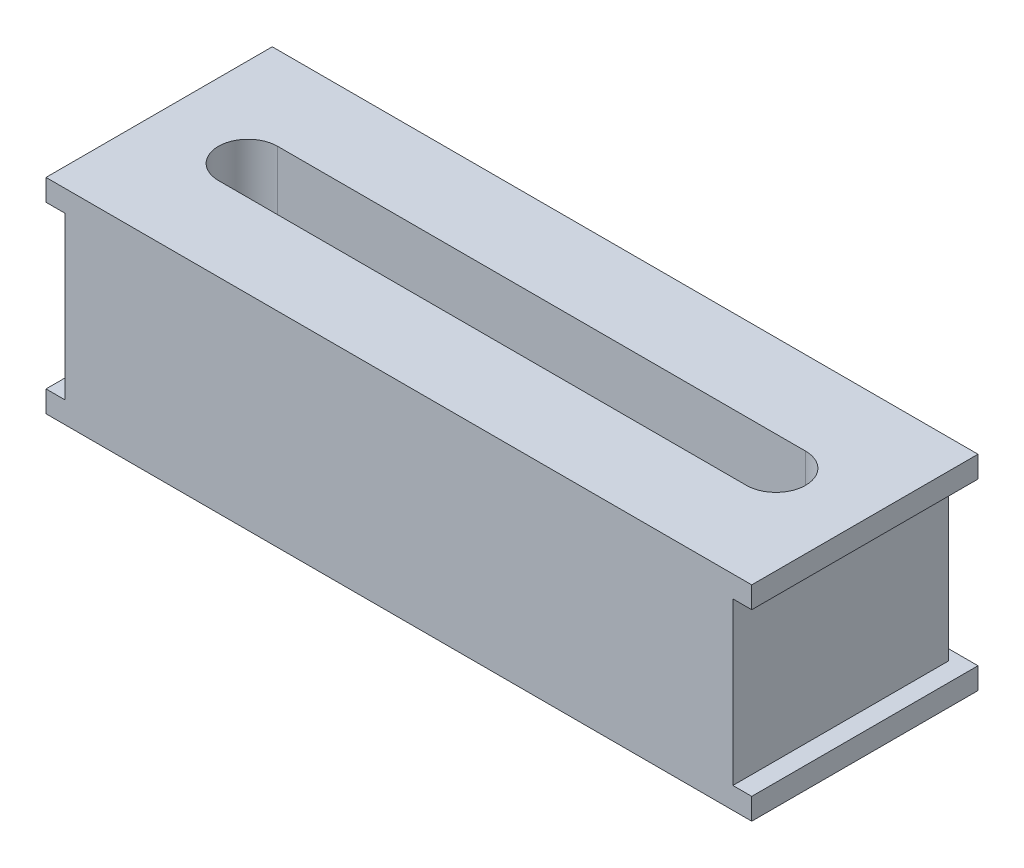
ISO-10303-21;
HEADER;
FILE_DESCRIPTION(('STEP AP214'),'2;1');
FILE_NAME('part.step','',(''),(''),'','','');
FILE_SCHEMA(('AUTOMOTIVE_DESIGN { 1 0 10303 214 1 1 1 1 }'));
ENDSEC;
DATA;
#1=APPLICATION_CONTEXT('core data for automotive mechanical design processes');
#2=APPLICATION_PROTOCOL_DEFINITION('international standard','automotive_design',2000,#1);
#3=PRODUCT_CONTEXT('',#1,'mechanical');
#4=PRODUCT('Part','Part','',(#3));
#5=PRODUCT_RELATED_PRODUCT_CATEGORY('part','',(#4));
#6=PRODUCT_DEFINITION_FORMATION('','',#4);
#7=PRODUCT_DEFINITION_CONTEXT('part definition',#1,'design');
#8=PRODUCT_DEFINITION('design','',#6,#7);
#9=PRODUCT_DEFINITION_SHAPE('','',#8);
#10=(LENGTH_UNIT() NAMED_UNIT(*) SI_UNIT(.MILLI.,.METRE.));
#11=(NAMED_UNIT(*) PLANE_ANGLE_UNIT() SI_UNIT($,.RADIAN.));
#12=(NAMED_UNIT(*) SI_UNIT($,.STERADIAN.) SOLID_ANGLE_UNIT());
#13=UNCERTAINTY_MEASURE_WITH_UNIT(LENGTH_MEASURE(1.E-05),#10,'distance_accuracy_value','');
#14=(GEOMETRIC_REPRESENTATION_CONTEXT(3) GLOBAL_UNCERTAINTY_ASSIGNED_CONTEXT((#13)) GLOBAL_UNIT_ASSIGNED_CONTEXT((#10,
#11,#12)) REPRESENTATION_CONTEXT('',''));
#15=CARTESIAN_POINT('',(0.,0.,0.));
#16=DIRECTION('',(0.,0.,1.));
#17=DIRECTION('',(1.,0.,0.));
#18=AXIS2_PLACEMENT_3D('',#15,#16,#17);
#19=CARTESIAN_POINT('',(-32.75,-8.95,10.5));
#20=DIRECTION('',(0.,1.,0.));
#21=DIRECTION('',(1.,0.,0.));
#22=AXIS2_PLACEMENT_3D('',#19,#20,#21);
#23=PLANE('',#22);
#24=DIRECTION('',(-1.,0.,0.));
#25=VECTOR('',#24,1.);
#26=CARTESIAN_POINT('',(26.0811388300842,-8.95,-2.25));
#27=LINE('',#26,#25);
#28=CARTESIAN_POINT('',(26.0811388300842,-8.95,-2.25));
#29=VERTEX_POINT('',#28);
#30=CARTESIAN_POINT('',(-18.75,-8.95,-2.25));
#31=VERTEX_POINT('',#30);
#32=EDGE_CURVE('E220',#29,#31,#27,.T.);
#33=ORIENTED_EDGE('',*,*,#32,.F.);
#34=CARTESIAN_POINT('',(24.5,-8.95,0.));
#35=DIRECTION('',(0.,-1.,0.));
#36=DIRECTION('',(0.,0.,1.));
#37=AXIS2_PLACEMENT_3D('',#34,#35,#36);
#38=CIRCLE('',#37,2.75);
#39=CARTESIAN_POINT('',(24.5,-8.95,-2.75));
#40=VERTEX_POINT('',#39);
#41=EDGE_CURVE('E18',#40,#29,#38,.T.);
#42=ORIENTED_EDGE('',*,*,#41,.F.);
#43=DIRECTION('',(1.,0.,0.));
#44=VECTOR('',#43,1.);
#45=CARTESIAN_POINT('',(0.,-8.95,-2.75));
#46=LINE('',#45,#44);
#47=CARTESIAN_POINT('',(-24.5,-8.95,-2.75));
#48=VERTEX_POINT('',#47);
#49=EDGE_CURVE('E9',#48,#40,#46,.T.);
#50=ORIENTED_EDGE('',*,*,#49,.F.);
#51=CARTESIAN_POINT('',(-24.5,-8.95,0.));
#52=DIRECTION('',(0.,-1.,0.));
#53=DIRECTION('',(0.,0.,1.));
#54=AXIS2_PLACEMENT_3D('',#51,#52,#53);
#55=CIRCLE('',#54,2.75);
#56=CARTESIAN_POINT('',(-24.5,-8.95,2.75));
#57=VERTEX_POINT('',#56);
#58=EDGE_CURVE('E204',#57,#48,#55,.T.);
#59=ORIENTED_EDGE('',*,*,#58,.F.);
#60=DIRECTION('',(-1.,0.,0.));
#61=VECTOR('',#60,1.);
#62=CARTESIAN_POINT('',(0.,-8.95,2.75));
#63=LINE('',#62,#61);
#64=CARTESIAN_POINT('',(-18.75,-8.95,2.75));
#65=VERTEX_POINT('',#64);
#66=EDGE_CURVE('E187',#65,#57,#63,.T.);
#67=ORIENTED_EDGE('',*,*,#66,.F.);
#68=CARTESIAN_POINT('',(-18.75,-8.95,0.25));
#69=DIRECTION('',(0.,1.,0.));
#70=DIRECTION('',(0.,0.,1.));
#71=AXIS2_PLACEMENT_3D('',#68,#69,#70);
#72=CIRCLE('',#71,2.5);
#73=EDGE_CURVE('E374',#31,#65,#72,.T.);
#74=ORIENTED_EDGE('',*,*,#73,.F.);
#75=EDGE_LOOP('',(#33,#42,#50,#59,#67,#74));
#76=FACE_BOUND('',#75,.T.);
#77=ADVANCED_FACE('F15',(#76),#23,.T.);
#78=CARTESIAN_POINT('',(24.5,10.5,-2.75));
#79=DIRECTION('',(0.,0.,-1.));
#80=DIRECTION('',(-1.,0.,0.));
#81=AXIS2_PLACEMENT_3D('',#78,#79,#80);
#82=PLANE('',#81);
#83=ORIENTED_EDGE('',*,*,#49,.T.);
#84=DIRECTION('',(0.,-1.,0.));
#85=VECTOR('',#84,1.);
#86=CARTESIAN_POINT('',(24.5,10.5,-2.75));
#87=LINE('',#86,#85);
#88=CARTESIAN_POINT('',(24.5,9.5,-2.75));
#89=VERTEX_POINT('',#88);
#90=EDGE_CURVE('E40',#89,#40,#87,.T.);
#91=ORIENTED_EDGE('',*,*,#90,.F.);
#92=DIRECTION('',(1.,0.,0.));
#93=VECTOR('',#92,1.);
#94=CARTESIAN_POINT('',(-32.75,9.5,-2.75));
#95=LINE('',#94,#93);
#96=CARTESIAN_POINT('',(-24.5,9.5,-2.75));
#97=VERTEX_POINT('',#96);
#98=EDGE_CURVE('E352',#97,#89,#95,.T.);
#99=ORIENTED_EDGE('',*,*,#98,.F.);
#100=DIRECTION('',(0.,-1.,0.));
#101=VECTOR('',#100,1.);
#102=CARTESIAN_POINT('',(-24.5,10.5,-2.75));
#103=LINE('',#102,#101);
#104=EDGE_CURVE('E209',#97,#48,#103,.T.);
#105=ORIENTED_EDGE('',*,*,#104,.T.);
#106=EDGE_LOOP('',(#83,#91,#99,#105));
#107=FACE_BOUND('',#106,.T.);
#108=ADVANCED_FACE('F470',(#107),#82,.F.);
#109=CARTESIAN_POINT('',(24.5,10.5,0.));
#110=DIRECTION('',(0.,-1.,0.));
#111=DIRECTION('',(0.,0.,-1.));
#112=AXIS2_PLACEMENT_3D('',#109,#110,#111);
#113=CYLINDRICAL_SURFACE('',#112,2.75);
#114=ORIENTED_EDGE('',*,*,#90,.T.);
#115=ORIENTED_EDGE('',*,*,#41,.T.);
#116=DIRECTION('',(0.,-1.,0.));
#117=VECTOR('',#116,1.);
#118=CARTESIAN_POINT('',(26.0811388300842,-8.,-2.25));
#119=LINE('',#118,#117);
#120=CARTESIAN_POINT('',(26.0811388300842,-9.5,-2.25));
#121=VERTEX_POINT('',#120);
#122=EDGE_CURVE('E373',#29,#121,#119,.T.);
#123=ORIENTED_EDGE('',*,*,#122,.T.);
#124=CARTESIAN_POINT('',(24.5,-9.5,0.));
#125=DIRECTION('',(0.,-1.,0.));
#126=DIRECTION('',(0.,0.,-1.));
#127=AXIS2_PLACEMENT_3D('',#124,#125,#126);
#128=CIRCLE('',#127,2.75);
#129=CARTESIAN_POINT('',(24.5,-9.5,2.75));
#130=VERTEX_POINT('',#129);
#131=EDGE_CURVE('E346',#121,#130,#128,.T.);
#132=ORIENTED_EDGE('',*,*,#131,.T.);
#133=DIRECTION('',(0.,-1.,0.));
#134=VECTOR('',#133,1.);
#135=CARTESIAN_POINT('',(24.5,10.5,2.75));
#136=LINE('',#135,#134);
#137=CARTESIAN_POINT('',(24.5,9.5,2.75));
#138=VERTEX_POINT('',#137);
#139=EDGE_CURVE('E231',#138,#130,#136,.T.);
#140=ORIENTED_EDGE('',*,*,#139,.F.);
#141=CARTESIAN_POINT('',(24.5,9.5,0.));
#142=DIRECTION('',(0.,-1.,0.));
#143=DIRECTION('',(0.,0.,-1.));
#144=AXIS2_PLACEMENT_3D('',#141,#142,#143);
#145=CIRCLE('',#144,2.75);
#146=EDGE_CURVE('E356',#89,#138,#145,.T.);
#147=ORIENTED_EDGE('',*,*,#146,.F.);
#148=EDGE_LOOP('',(#114,#115,#123,#132,#140,#147));
#149=FACE_BOUND('',#148,.T.);
#150=ADVANCED_FACE('F371',(#149),#113,.F.);
#151=CARTESIAN_POINT('',(32.75,-7.5,-9.5));
#152=DIRECTION('',(0.,0.,-1.));
#153=DIRECTION('',(0.,-1.,0.));
#154=AXIS2_PLACEMENT_3D('',#151,#152,#153);
#155=PLANE('',#154);
#156=DIRECTION('',(0.,-1.,0.));
#157=VECTOR('',#156,1.);
#158=CARTESIAN_POINT('',(31.,1.75,-9.5));
#159=LINE('',#158,#157);
#160=CARTESIAN_POINT('',(31.,7.5,-9.5));
#161=VERTEX_POINT('',#160);
#162=CARTESIAN_POINT('',(31.,-7.5,-9.5));
#163=VERTEX_POINT('',#162);
#164=EDGE_CURVE('E256',#161,#163,#159,.T.);
#165=ORIENTED_EDGE('',*,*,#164,.T.);
#166=DIRECTION('',(-1.,0.,0.));
#167=VECTOR('',#166,1.);
#168=CARTESIAN_POINT('',(32.75,-7.5,-9.5));
#169=LINE('',#168,#167);
#170=CARTESIAN_POINT('',(-31.,-7.5,-9.5));
#171=VERTEX_POINT('',#170);
#172=EDGE_CURVE('E362',#163,#171,#169,.T.);
#173=ORIENTED_EDGE('',*,*,#172,.T.);
#174=DIRECTION('',(0.,-1.,0.));
#175=VECTOR('',#174,1.);
#176=CARTESIAN_POINT('',(-31.,1.75,-9.5));
#177=LINE('',#176,#175);
#178=CARTESIAN_POINT('',(-31.,7.5,-9.5));
#179=VERTEX_POINT('',#178);
#180=EDGE_CURVE('E285',#179,#171,#177,.T.);
#181=ORIENTED_EDGE('',*,*,#180,.F.);
#182=DIRECTION('',(1.,0.,0.));
#183=VECTOR('',#182,1.);
#184=CARTESIAN_POINT('',(32.75,7.5,-9.5));
#185=LINE('',#184,#183);
#186=EDGE_CURVE('E359',#179,#161,#185,.T.);
#187=ORIENTED_EDGE('',*,*,#186,.T.);
#188=EDGE_LOOP('',(#165,#173,#181,#187));
#189=FACE_BOUND('',#188,.T.);
#190=ADVANCED_FACE('F407',(#189),#155,.T.);
#191=CARTESIAN_POINT('',(32.75,-7.5,-11.5));
#192=DIRECTION('',(0.,-1.,0.));
#193=DIRECTION('',(0.,0.,-1.));
#194=AXIS2_PLACEMENT_3D('',#191,#192,#193);
#195=PLANE('',#194);
#196=DIRECTION('',(0.,0.,1.));
#197=VECTOR('',#196,1.);
#198=CARTESIAN_POINT('',(31.,-7.5,-24.6017383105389));
#199=LINE('',#198,#197);
#200=CARTESIAN_POINT('',(31.,-7.5,10.5));
#201=VERTEX_POINT('',#200);
#202=EDGE_CURVE('E268',#163,#201,#199,.T.);
#203=ORIENTED_EDGE('',*,*,#202,.T.);
#204=DIRECTION('',(1.,0.,0.));
#205=VECTOR('',#204,1.);
#206=CARTESIAN_POINT('',(32.75,-7.5,10.5));
#207=LINE('',#206,#205);
#208=CARTESIAN_POINT('',(32.75,-7.5,10.5));
#209=VERTEX_POINT('',#208);
#210=EDGE_CURVE('E310',#201,#209,#207,.T.);
#211=ORIENTED_EDGE('',*,*,#210,.T.);
#212=DIRECTION('',(0.,0.,1.));
#213=VECTOR('',#212,1.);
#214=CARTESIAN_POINT('',(32.75,-7.5,-11.5));
#215=LINE('',#214,#213);
#216=CARTESIAN_POINT('',(32.75,-7.5,-10.5));
#217=VERTEX_POINT('',#216);
#218=EDGE_CURVE('E349',#217,#209,#215,.T.);
#219=ORIENTED_EDGE('',*,*,#218,.F.);
#220=DIRECTION('',(1.,0.,0.));
#221=VECTOR('',#220,1.);
#222=CARTESIAN_POINT('',(-32.75,-7.5,-10.5));
#223=LINE('',#222,#221);
#224=CARTESIAN_POINT('',(-32.75,-7.5,-10.5));
#225=VERTEX_POINT('',#224);
#226=EDGE_CURVE('E327',#225,#217,#223,.T.);
#227=ORIENTED_EDGE('',*,*,#226,.F.);
#228=DIRECTION('',(0.,0.,1.));
#229=VECTOR('',#228,1.);
#230=CARTESIAN_POINT('',(-32.75,-7.5,-11.5));
#231=LINE('',#230,#229);
#232=CARTESIAN_POINT('',(-32.75,-7.5,10.5));
#233=VERTEX_POINT('',#232);
#234=EDGE_CURVE('E293',#225,#233,#231,.T.);
#235=ORIENTED_EDGE('',*,*,#234,.T.);
#236=DIRECTION('',(-1.,0.,0.));
#237=VECTOR('',#236,1.);
#238=CARTESIAN_POINT('',(-32.75,-7.5,10.5));
#239=LINE('',#238,#237);
#240=CARTESIAN_POINT('',(-31.,-7.5,10.5));
#241=VERTEX_POINT('',#240);
#242=EDGE_CURVE('E241',#241,#233,#239,.T.);
#243=ORIENTED_EDGE('',*,*,#242,.F.);
#244=DIRECTION('',(0.,0.,1.));
#245=VECTOR('',#244,1.);
#246=CARTESIAN_POINT('',(-31.,-7.5,-24.6017383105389));
#247=LINE('',#246,#245);
#248=EDGE_CURVE('E289',#171,#241,#247,.T.);
#249=ORIENTED_EDGE('',*,*,#248,.F.);
#250=ORIENTED_EDGE('',*,*,#172,.F.);
#251=EDGE_LOOP('',(#203,#211,#219,#227,#235,#243,#249,#250));
#252=FACE_BOUND('',#251,.T.);
#253=ADVANCED_FACE('F457',(#252),#195,.F.);
#254=CARTESIAN_POINT('',(32.75,7.5,-11.5));
#255=DIRECTION('',(0.,1.,0.));
#256=DIRECTION('',(1.,0.,0.));
#257=AXIS2_PLACEMENT_3D('',#254,#255,#256);
#258=PLANE('',#257);
#259=DIRECTION('',(-1.,0.,0.));
#260=VECTOR('',#259,1.);
#261=CARTESIAN_POINT('',(32.75,7.5,10.5));
#262=LINE('',#261,#260);
#263=CARTESIAN_POINT('',(32.75,7.5,10.5));
#264=VERTEX_POINT('',#263);
#265=CARTESIAN_POINT('',(31.,7.5,10.5));
#266=VERTEX_POINT('',#265);
#267=EDGE_CURVE('E315',#264,#266,#262,.T.);
#268=ORIENTED_EDGE('',*,*,#267,.T.);
#269=DIRECTION('',(0.,0.,1.));
#270=VECTOR('',#269,1.);
#271=CARTESIAN_POINT('',(31.,7.5,-24.6017383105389));
#272=LINE('',#271,#270);
#273=EDGE_CURVE('E260',#161,#266,#272,.T.);
#274=ORIENTED_EDGE('',*,*,#273,.F.);
#275=ORIENTED_EDGE('',*,*,#186,.F.);
#276=DIRECTION('',(0.,0.,1.));
#277=VECTOR('',#276,1.);
#278=CARTESIAN_POINT('',(-31.,7.5,-24.6017383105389));
#279=LINE('',#278,#277);
#280=CARTESIAN_POINT('',(-31.,7.5,10.5));
#281=VERTEX_POINT('',#280);
#282=EDGE_CURVE('E281',#179,#281,#279,.T.);
#283=ORIENTED_EDGE('',*,*,#282,.T.);
#284=DIRECTION('',(1.,0.,0.));
#285=VECTOR('',#284,1.);
#286=CARTESIAN_POINT('',(-32.75,7.5,10.5));
#287=LINE('',#286,#285);
#288=CARTESIAN_POINT('',(-32.75,7.5,10.5));
#289=VERTEX_POINT('',#288);
#290=EDGE_CURVE('E238',#289,#281,#287,.T.);
#291=ORIENTED_EDGE('',*,*,#290,.F.);
#292=DIRECTION('',(0.,0.,1.));
#293=VECTOR('',#292,1.);
#294=CARTESIAN_POINT('',(-32.75,7.5,-11.5));
#295=LINE('',#294,#293);
#296=CARTESIAN_POINT('',(-32.75,7.5,-10.5));
#297=VERTEX_POINT('',#296);
#298=EDGE_CURVE('E306',#297,#289,#295,.T.);
#299=ORIENTED_EDGE('',*,*,#298,.F.);
#300=DIRECTION('',(-1.,0.,0.));
#301=VECTOR('',#300,1.);
#302=CARTESIAN_POINT('',(-32.75,7.5,-10.5));
#303=LINE('',#302,#301);
#304=CARTESIAN_POINT('',(32.75,7.5,-10.5));
#305=VERTEX_POINT('',#304);
#306=EDGE_CURVE('E228',#305,#297,#303,.T.);
#307=ORIENTED_EDGE('',*,*,#306,.F.);
#308=DIRECTION('',(0.,0.,1.));
#309=VECTOR('',#308,1.);
#310=CARTESIAN_POINT('',(32.75,7.5,-11.5));
#311=LINE('',#310,#309);
#312=EDGE_CURVE('E339',#305,#264,#311,.T.);
#313=ORIENTED_EDGE('',*,*,#312,.T.);
#314=EDGE_LOOP('',(#268,#274,#275,#283,#291,#299,#307,#313));
#315=FACE_BOUND('',#314,.T.);
#316=ADVANCED_FACE('F397',(#315),#258,.F.);
#317=CARTESIAN_POINT('',(-32.75,9.5,10.5));
#318=DIRECTION('',(0.,-1.,0.));
#319=DIRECTION('',(0.,0.,-1.));
#320=AXIS2_PLACEMENT_3D('',#317,#318,#319);
#321=PLANE('',#320);
#322=DIRECTION('',(-1.,0.,0.));
#323=VECTOR('',#322,1.);
#324=CARTESIAN_POINT('',(-32.75,9.5,2.75));
#325=LINE('',#324,#323);
#326=CARTESIAN_POINT('',(-24.5,9.5,2.75));
#327=VERTEX_POINT('',#326);
#328=EDGE_CURVE('E200',#138,#327,#325,.T.);
#329=ORIENTED_EDGE('',*,*,#328,.T.);
#330=CARTESIAN_POINT('',(-24.5,9.5,0.));
#331=DIRECTION('',(0.,-1.,0.));
#332=DIRECTION('',(0.,0.,-1.));
#333=AXIS2_PLACEMENT_3D('',#330,#331,#332);
#334=CIRCLE('',#333,2.75);
#335=EDGE_CURVE('E214',#327,#97,#334,.T.);
#336=ORIENTED_EDGE('',*,*,#335,.T.);
#337=ORIENTED_EDGE('',*,*,#98,.T.);
#338=ORIENTED_EDGE('',*,*,#146,.T.);
#339=EDGE_LOOP('',(#329,#336,#337,#338));
#340=FACE_BOUND('',#339,.T.);
#341=DIRECTION('',(0.,0.,-1.));
#342=VECTOR('',#341,1.);
#343=CARTESIAN_POINT('',(32.75,9.5,10.5));
#344=LINE('',#343,#342);
#345=CARTESIAN_POINT('',(32.75,9.5,10.5));
#346=VERTEX_POINT('',#345);
#347=CARTESIAN_POINT('',(32.75,9.5,-10.5));
#348=VERTEX_POINT('',#347);
#349=EDGE_CURVE('E340',#346,#348,#344,.T.);
#350=ORIENTED_EDGE('',*,*,#349,.T.);
#351=DIRECTION('',(-1.,0.,0.));
#352=VECTOR('',#351,1.);
#353=CARTESIAN_POINT('',(-32.75,9.5,-10.5));
#354=LINE('',#353,#352);
#355=CARTESIAN_POINT('',(-32.75,9.5,-10.5));
#356=VERTEX_POINT('',#355);
#357=EDGE_CURVE('E248',#348,#356,#354,.T.);
#358=ORIENTED_EDGE('',*,*,#357,.T.);
#359=DIRECTION('',(0.,0.,-1.));
#360=VECTOR('',#359,1.);
#361=CARTESIAN_POINT('',(-32.75,9.5,10.5));
#362=LINE('',#361,#360);
#363=CARTESIAN_POINT('',(-32.75,9.5,10.5));
#364=VERTEX_POINT('',#363);
#365=EDGE_CURVE('E307',#364,#356,#362,.T.);
#366=ORIENTED_EDGE('',*,*,#365,.F.);
#367=DIRECTION('',(-1.,0.,0.));
#368=VECTOR('',#367,1.);
#369=CARTESIAN_POINT('',(-32.75,9.5,10.5));
#370=LINE('',#369,#368);
#371=EDGE_CURVE('E242',#346,#364,#370,.T.);
#372=ORIENTED_EDGE('',*,*,#371,.F.);
#373=EDGE_LOOP('',(#350,#358,#366,#372));
#374=FACE_BOUND('',#373,.T.);
#375=ADVANCED_FACE('F465',(#340,#374),#321,.F.);
#376=CARTESIAN_POINT('',(32.75,9.5,10.5));
#377=DIRECTION('',(-1.,0.,0.));
#378=DIRECTION('',(0.,1.,0.));
#379=AXIS2_PLACEMENT_3D('',#376,#377,#378);
#380=PLANE('',#379);
#381=DIRECTION('',(0.,1.,0.));
#382=VECTOR('',#381,1.);
#383=CARTESIAN_POINT('',(32.75,9.5,-10.5));
#384=LINE('',#383,#382);
#385=CARTESIAN_POINT('',(32.75,-9.5,-10.5));
#386=VERTEX_POINT('',#385);
#387=EDGE_CURVE('E331',#386,#217,#384,.T.);
#388=ORIENTED_EDGE('',*,*,#387,.T.);
#389=ORIENTED_EDGE('',*,*,#218,.T.);
#390=DIRECTION('',(0.,1.,0.));
#391=VECTOR('',#390,1.);
#392=CARTESIAN_POINT('',(32.75,9.5,10.5));
#393=LINE('',#392,#391);
#394=CARTESIAN_POINT('',(32.75,-9.5,10.5));
#395=VERTEX_POINT('',#394);
#396=EDGE_CURVE('E273',#395,#209,#393,.T.);
#397=ORIENTED_EDGE('',*,*,#396,.F.);
#398=DIRECTION('',(0.,0.,-1.));
#399=VECTOR('',#398,1.);
#400=CARTESIAN_POINT('',(32.75,-9.5,10.5));
#401=LINE('',#400,#399);
#402=EDGE_CURVE('E343',#395,#386,#401,.T.);
#403=ORIENTED_EDGE('',*,*,#402,.T.);
#404=EDGE_LOOP('',(#388,#389,#397,#403));
#405=FACE_BOUND('',#404,.T.);
#406=ADVANCED_FACE('F454',(#405),#380,.F.);
#407=CARTESIAN_POINT('',(-32.75,-9.5,10.5));
#408=DIRECTION('',(0.,1.,0.));
#409=DIRECTION('',(1.,0.,0.));
#410=AXIS2_PLACEMENT_3D('',#407,#408,#409);
#411=PLANE('',#410);
#412=ORIENTED_EDGE('',*,*,#131,.F.);
#413=DIRECTION('',(-1.,0.,0.));
#414=VECTOR('',#413,1.);
#415=CARTESIAN_POINT('',(26.0811388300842,-9.5,-2.25));
#416=LINE('',#415,#414);
#417=CARTESIAN_POINT('',(-18.75,-9.5,-2.25));
#418=VERTEX_POINT('',#417);
#419=EDGE_CURVE('E216',#121,#418,#416,.T.);
#420=ORIENTED_EDGE('',*,*,#419,.T.);
#421=CARTESIAN_POINT('',(-18.75,-9.5,0.25));
#422=DIRECTION('',(0.,1.,0.));
#423=DIRECTION('',(0.,0.,1.));
#424=AXIS2_PLACEMENT_3D('',#421,#422,#423);
#425=CIRCLE('',#424,2.5);
#426=CARTESIAN_POINT('',(-18.75,-9.5,2.75));
#427=VERTEX_POINT('',#426);
#428=EDGE_CURVE('E383',#418,#427,#425,.T.);
#429=ORIENTED_EDGE('',*,*,#428,.T.);
#430=DIRECTION('',(-1.,0.,0.));
#431=VECTOR('',#430,1.);
#432=CARTESIAN_POINT('',(-24.5,-9.5,2.75));
#433=LINE('',#432,#431);
#434=EDGE_CURVE('E201',#130,#427,#433,.T.);
#435=ORIENTED_EDGE('',*,*,#434,.F.);
#436=EDGE_LOOP('',(#412,#420,#429,#435));
#437=FACE_BOUND('',#436,.T.);
#438=DIRECTION('',(0.,0.,-1.));
#439=VECTOR('',#438,1.);
#440=CARTESIAN_POINT('',(-32.75,-9.5,10.5));
#441=LINE('',#440,#439);
#442=CARTESIAN_POINT('',(-32.75,-9.5,10.5));
#443=VERTEX_POINT('',#442);
#444=CARTESIAN_POINT('',(-32.75,-9.5,-10.5));
#445=VERTEX_POINT('',#444);
#446=EDGE_CURVE('E301',#443,#445,#441,.T.);
#447=ORIENTED_EDGE('',*,*,#446,.T.);
#448=DIRECTION('',(1.,0.,0.));
#449=VECTOR('',#448,1.);
#450=CARTESIAN_POINT('',(-32.75,-9.5,-10.5));
#451=LINE('',#450,#449);
#452=EDGE_CURVE('E335',#445,#386,#451,.T.);
#453=ORIENTED_EDGE('',*,*,#452,.T.);
#454=ORIENTED_EDGE('',*,*,#402,.F.);
#455=DIRECTION('',(1.,0.,0.));
#456=VECTOR('',#455,1.);
#457=CARTESIAN_POINT('',(-32.75,-9.5,10.5));
#458=LINE('',#457,#456);
#459=EDGE_CURVE('E269',#443,#395,#458,.T.);
#460=ORIENTED_EDGE('',*,*,#459,.F.);
#461=EDGE_LOOP('',(#447,#453,#454,#460));
#462=FACE_BOUND('',#461,.T.);
#463=ADVANCED_FACE('F445',(#437,#462),#411,.F.);
#464=CARTESIAN_POINT('',(32.75,9.5,10.5));
#465=DIRECTION('',(-1.,0.,0.));
#466=DIRECTION('',(0.,1.,0.));
#467=AXIS2_PLACEMENT_3D('',#464,#465,#466);
#468=PLANE('',#467);
#469=DIRECTION('',(0.,1.,0.));
#470=VECTOR('',#469,1.);
#471=CARTESIAN_POINT('',(32.75,9.5,10.5));
#472=LINE('',#471,#470);
#473=EDGE_CURVE('E316',#264,#346,#472,.T.);
#474=ORIENTED_EDGE('',*,*,#473,.F.);
#475=ORIENTED_EDGE('',*,*,#312,.F.);
#476=DIRECTION('',(0.,1.,0.));
#477=VECTOR('',#476,1.);
#478=CARTESIAN_POINT('',(32.75,9.5,-10.5));
#479=LINE('',#478,#477);
#480=EDGE_CURVE('E252',#305,#348,#479,.T.);
#481=ORIENTED_EDGE('',*,*,#480,.T.);
#482=ORIENTED_EDGE('',*,*,#349,.F.);
#483=EDGE_LOOP('',(#474,#475,#481,#482));
#484=FACE_BOUND('',#483,.T.);
#485=ADVANCED_FACE('F529',(#484),#468,.F.);
#486=CARTESIAN_POINT('',(-32.75,-9.5,-10.5));
#487=DIRECTION('',(0.,0.,1.));
#488=DIRECTION('',(1.,0.,0.));
#489=AXIS2_PLACEMENT_3D('',#486,#487,#488);
#490=PLANE('',#489);
#491=DIRECTION('',(0.,-1.,0.));
#492=VECTOR('',#491,1.);
#493=CARTESIAN_POINT('',(-32.75,9.5,-10.5));
#494=LINE('',#493,#492);
#495=EDGE_CURVE('E297',#225,#445,#494,.T.);
#496=ORIENTED_EDGE('',*,*,#495,.F.);
#497=ORIENTED_EDGE('',*,*,#226,.T.);
#498=ORIENTED_EDGE('',*,*,#387,.F.);
#499=ORIENTED_EDGE('',*,*,#452,.F.);
#500=EDGE_LOOP('',(#496,#497,#498,#499));
#501=FACE_BOUND('',#500,.T.);
#502=ADVANCED_FACE('F452',(#501),#490,.F.);
#503=CARTESIAN_POINT('',(-32.75,-9.5,10.5));
#504=DIRECTION('',(0.,0.,1.));
#505=DIRECTION('',(1.,0.,0.));
#506=AXIS2_PLACEMENT_3D('',#503,#504,#505);
#507=PLANE('',#506);
#508=ORIENTED_EDGE('',*,*,#210,.F.);
#509=DIRECTION('',(0.,-1.,0.));
#510=VECTOR('',#509,1.);
#511=CARTESIAN_POINT('',(31.,1.75,10.5));
#512=LINE('',#511,#510);
#513=EDGE_CURVE('E264',#266,#201,#512,.T.);
#514=ORIENTED_EDGE('',*,*,#513,.F.);
#515=ORIENTED_EDGE('',*,*,#267,.F.);
#516=ORIENTED_EDGE('',*,*,#473,.T.);
#517=ORIENTED_EDGE('',*,*,#371,.T.);
#518=DIRECTION('',(0.,-1.,0.));
#519=VECTOR('',#518,1.);
#520=CARTESIAN_POINT('',(-32.75,9.5,10.5));
#521=LINE('',#520,#519);
#522=EDGE_CURVE('E311',#364,#289,#521,.T.);
#523=ORIENTED_EDGE('',*,*,#522,.T.);
#524=ORIENTED_EDGE('',*,*,#290,.T.);
#525=DIRECTION('',(0.,-1.,0.));
#526=VECTOR('',#525,1.);
#527=CARTESIAN_POINT('',(-31.,1.75,10.5));
#528=LINE('',#527,#526);
#529=EDGE_CURVE('E276',#281,#241,#528,.T.);
#530=ORIENTED_EDGE('',*,*,#529,.T.);
#531=ORIENTED_EDGE('',*,*,#242,.T.);
#532=DIRECTION('',(0.,-1.,0.));
#533=VECTOR('',#532,1.);
#534=CARTESIAN_POINT('',(-32.75,9.5,10.5));
#535=LINE('',#534,#533);
#536=EDGE_CURVE('E302',#233,#443,#535,.T.);
#537=ORIENTED_EDGE('',*,*,#536,.T.);
#538=ORIENTED_EDGE('',*,*,#459,.T.);
#539=ORIENTED_EDGE('',*,*,#396,.T.);
#540=EDGE_LOOP('',(#508,#514,#515,#516,#517,#523,#524,#530,#531,#537,#538,#539));
#541=FACE_BOUND('',#540,.T.);
#542=ADVANCED_FACE('F402',(#541),#507,.T.);
#543=CARTESIAN_POINT('',(-32.75,9.5,10.5));
#544=DIRECTION('',(1.,0.,0.));
#545=DIRECTION('',(0.,1.,0.));
#546=AXIS2_PLACEMENT_3D('',#543,#544,#545);
#547=PLANE('',#546);
#548=ORIENTED_EDGE('',*,*,#298,.T.);
#549=ORIENTED_EDGE('',*,*,#522,.F.);
#550=ORIENTED_EDGE('',*,*,#365,.T.);
#551=DIRECTION('',(0.,-1.,0.));
#552=VECTOR('',#551,1.);
#553=CARTESIAN_POINT('',(-32.75,9.5,-10.5));
#554=LINE('',#553,#552);
#555=EDGE_CURVE('E235',#356,#297,#554,.T.);
#556=ORIENTED_EDGE('',*,*,#555,.T.);
#557=EDGE_LOOP('',(#548,#549,#550,#556));
#558=FACE_BOUND('',#557,.T.);
#559=ADVANCED_FACE('F423',(#558),#547,.F.);
#560=CARTESIAN_POINT('',(-32.75,9.5,10.5));
#561=DIRECTION('',(1.,0.,0.));
#562=DIRECTION('',(0.,1.,0.));
#563=AXIS2_PLACEMENT_3D('',#560,#561,#562);
#564=PLANE('',#563);
#565=ORIENTED_EDGE('',*,*,#234,.F.);
#566=ORIENTED_EDGE('',*,*,#495,.T.);
#567=ORIENTED_EDGE('',*,*,#446,.F.);
#568=ORIENTED_EDGE('',*,*,#536,.F.);
#569=EDGE_LOOP('',(#565,#566,#567,#568));
#570=FACE_BOUND('',#569,.T.);
#571=ADVANCED_FACE('F450',(#570),#564,.F.);
#572=CARTESIAN_POINT('',(-31.,1.75,-11.5));
#573=DIRECTION('',(-1.,0.,0.));
#574=DIRECTION('',(0.,0.,1.));
#575=AXIS2_PLACEMENT_3D('',#572,#573,#574);
#576=PLANE('',#575);
#577=ORIENTED_EDGE('',*,*,#529,.F.);
#578=ORIENTED_EDGE('',*,*,#282,.F.);
#579=ORIENTED_EDGE('',*,*,#180,.T.);
#580=ORIENTED_EDGE('',*,*,#248,.T.);
#581=EDGE_LOOP('',(#577,#578,#579,#580));
#582=FACE_BOUND('',#581,.T.);
#583=ADVANCED_FACE('F414',(#582),#576,.T.);
#584=CARTESIAN_POINT('',(31.,1.75,-11.5));
#585=DIRECTION('',(-1.,0.,0.));
#586=DIRECTION('',(0.,0.,1.));
#587=AXIS2_PLACEMENT_3D('',#584,#585,#586);
#588=PLANE('',#587);
#589=ORIENTED_EDGE('',*,*,#164,.F.);
#590=ORIENTED_EDGE('',*,*,#273,.T.);
#591=ORIENTED_EDGE('',*,*,#513,.T.);
#592=ORIENTED_EDGE('',*,*,#202,.F.);
#593=EDGE_LOOP('',(#589,#590,#591,#592));
#594=FACE_BOUND('',#593,.T.);
#595=ADVANCED_FACE('F405',(#594),#588,.F.);
#596=CARTESIAN_POINT('',(-32.75,-9.5,-10.5));
#597=DIRECTION('',(0.,0.,1.));
#598=DIRECTION('',(1.,0.,0.));
#599=AXIS2_PLACEMENT_3D('',#596,#597,#598);
#600=PLANE('',#599);
#601=ORIENTED_EDGE('',*,*,#306,.T.);
#602=ORIENTED_EDGE('',*,*,#555,.F.);
#603=ORIENTED_EDGE('',*,*,#357,.F.);
#604=ORIENTED_EDGE('',*,*,#480,.F.);
#605=EDGE_LOOP('',(#601,#602,#603,#604));
#606=FACE_BOUND('',#605,.T.);
#607=ADVANCED_FACE('F594',(#606),#600,.F.);
#608=CARTESIAN_POINT('',(-24.5,10.5,2.75));
#609=DIRECTION('',(0.,0.,1.));
#610=DIRECTION('',(1.,0.,0.));
#611=AXIS2_PLACEMENT_3D('',#608,#609,#610);
#612=PLANE('',#611);
#613=ORIENTED_EDGE('',*,*,#139,.T.);
#614=ORIENTED_EDGE('',*,*,#434,.T.);
#615=DIRECTION('',(0.,-1.,0.));
#616=VECTOR('',#615,1.);
#617=CARTESIAN_POINT('',(-18.75,-8.,2.75));
#618=LINE('',#617,#616);
#619=EDGE_CURVE('E195',#65,#427,#618,.T.);
#620=ORIENTED_EDGE('',*,*,#619,.F.);
#621=ORIENTED_EDGE('',*,*,#66,.T.);
#622=DIRECTION('',(0.,-1.,0.));
#623=VECTOR('',#622,1.);
#624=CARTESIAN_POINT('',(-24.5,10.5,2.75));
#625=LINE('',#624,#623);
#626=EDGE_CURVE('E193',#327,#57,#625,.T.);
#627=ORIENTED_EDGE('',*,*,#626,.F.);
#628=ORIENTED_EDGE('',*,*,#328,.F.);
#629=EDGE_LOOP('',(#613,#614,#620,#621,#627,#628));
#630=FACE_BOUND('',#629,.T.);
#631=ADVANCED_FACE('F190',(#630),#612,.F.);
#632=CARTESIAN_POINT('',(-24.5,10.5,0.));
#633=DIRECTION('',(0.,-1.,0.));
#634=DIRECTION('',(0.,0.,-1.));
#635=AXIS2_PLACEMENT_3D('',#632,#633,#634);
#636=CYLINDRICAL_SURFACE('',#635,2.75);
#637=ORIENTED_EDGE('',*,*,#626,.T.);
#638=ORIENTED_EDGE('',*,*,#58,.T.);
#639=ORIENTED_EDGE('',*,*,#104,.F.);
#640=ORIENTED_EDGE('',*,*,#335,.F.);
#641=EDGE_LOOP('',(#637,#638,#639,#640));
#642=FACE_BOUND('',#641,.T.);
#643=ADVANCED_FACE('F212',(#642),#636,.F.);
#644=CARTESIAN_POINT('',(26.0811388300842,-8.,-2.25));
#645=DIRECTION('',(0.,0.,1.));
#646=DIRECTION('',(1.,0.,0.));
#647=AXIS2_PLACEMENT_3D('',#644,#645,#646);
#648=PLANE('',#647);
#649=ORIENTED_EDGE('',*,*,#122,.F.);
#650=ORIENTED_EDGE('',*,*,#32,.T.);
#651=DIRECTION('',(0.,-1.,0.));
#652=VECTOR('',#651,1.);
#653=CARTESIAN_POINT('',(-18.75,-8.,-2.25));
#654=LINE('',#653,#652);
#655=EDGE_CURVE('E435',#31,#418,#654,.T.);
#656=ORIENTED_EDGE('',*,*,#655,.T.);
#657=ORIENTED_EDGE('',*,*,#419,.F.);
#658=EDGE_LOOP('',(#649,#650,#656,#657));
#659=FACE_BOUND('',#658,.T.);
#660=ADVANCED_FACE('F381',(#659),#648,.T.);
#661=CARTESIAN_POINT('',(-18.75,-8.,0.25));
#662=DIRECTION('',(0.,-1.,0.));
#663=DIRECTION('',(0.,0.,-1.));
#664=AXIS2_PLACEMENT_3D('',#661,#662,#663);
#665=CYLINDRICAL_SURFACE('',#664,2.5);
#666=ORIENTED_EDGE('',*,*,#655,.F.);
#667=ORIENTED_EDGE('',*,*,#73,.T.);
#668=ORIENTED_EDGE('',*,*,#619,.T.);
#669=ORIENTED_EDGE('',*,*,#428,.F.);
#670=EDGE_LOOP('',(#666,#667,#668,#669));
#671=FACE_BOUND('',#670,.T.);
#672=ADVANCED_FACE('F632',(#671),#665,.F.);
#673=CLOSED_SHELL('',(#77,#108,#150,#190,#253,#316,#375,#406,#463,#485,#502,#542,#559,#571,#583,
#595,#607,#631,#643,#660,#672));
#674=MANIFOLD_SOLID_BREP('B1',#673);
#675=ADVANCED_BREP_SHAPE_REPRESENTATION('',(#18,#674),#14);
#676=SHAPE_DEFINITION_REPRESENTATION(#9,#675);
ENDSEC;
END-ISO-10303-21;
